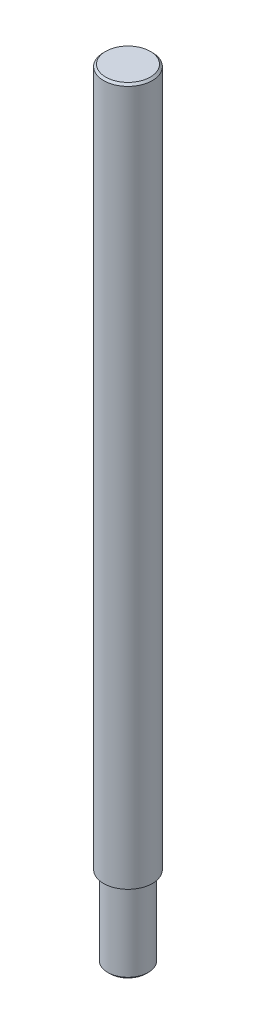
from build123d import *

# Parameters (mm, degrees)
SKETCH1_R      = 2.5
EXTRUDE1_DEPTH = 10
SKETCH2_R      = 3
EXTRUDE2_DEPTH = 86
CHAMFER1_SIZE  = 0.25
CHAMFER2_SIZE  = 0.25


with BuildPart() as part:
    # Sketch1 → Extrude1 (new body)
    with BuildSketch(Plane(origin=(0, 0, 0), x_dir=(1, 0, 0), z_dir=(0, 1, 0))):
        with Locations(Location((0, 0, 0), (0, 0, 270))):
            Circle(SKETCH1_R)
    extrude(amount=-EXTRUDE1_DEPTH)

    # Sketch2 → Extrude2 (add)
    with BuildSketch(Plane(origin=(0, 0, 0), x_dir=(-1, 0, 0), z_dir=(0, 1, 0))):
        with Locations(Location((0, 0, 0), (0, 0, 90))):
            Circle(SKETCH2_R)
    extrude(amount=EXTRUDE2_DEPTH)

    # Chamfer1
    chamfer1_edges = [part.edges().sort_by_distance(p)[0] for p in [
        (0, 86, -3),
    ]]
    chamfer(chamfer1_edges, length=CHAMFER1_SIZE)

    # Chamfer2
    chamfer2_edges = [part.edges().sort_by_distance(p)[0] for p in [
        (0, -10, -2.5),
    ]]
    chamfer(chamfer2_edges, length=CHAMFER2_SIZE)


solid = part.part
